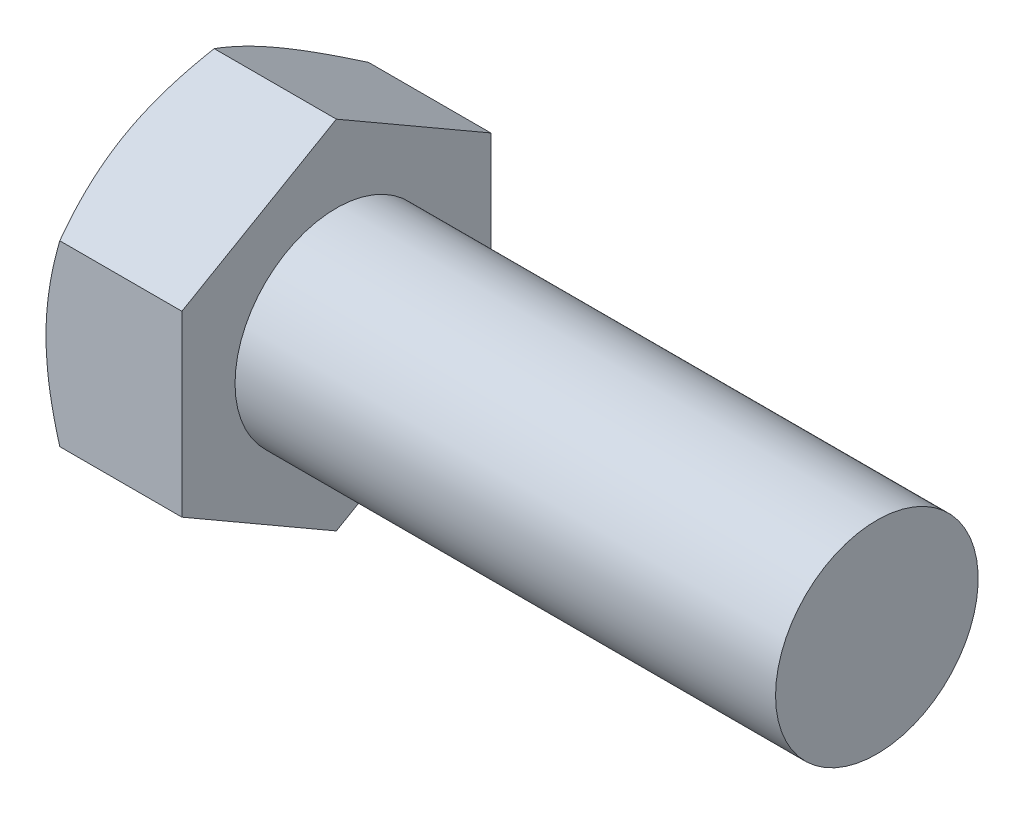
ISO-10303-21;
HEADER;
FILE_DESCRIPTION(('STEP AP214'),'2;1');
FILE_NAME('part.step','',(''),(''),'','','');
FILE_SCHEMA(('AUTOMOTIVE_DESIGN { 1 0 10303 214 1 1 1 1 }'));
ENDSEC;
DATA;
#1=APPLICATION_CONTEXT('core data for automotive mechanical design processes');
#2=APPLICATION_PROTOCOL_DEFINITION('international standard','automotive_design',2000,#1);
#3=PRODUCT_CONTEXT('',#1,'mechanical');
#4=PRODUCT('Part','Part','',(#3));
#5=PRODUCT_RELATED_PRODUCT_CATEGORY('part','',(#4));
#6=PRODUCT_DEFINITION_FORMATION('','',#4);
#7=PRODUCT_DEFINITION_CONTEXT('part definition',#1,'design');
#8=PRODUCT_DEFINITION('design','',#6,#7);
#9=PRODUCT_DEFINITION_SHAPE('','',#8);
#10=(LENGTH_UNIT() NAMED_UNIT(*) SI_UNIT(.MILLI.,.METRE.));
#11=(NAMED_UNIT(*) PLANE_ANGLE_UNIT() SI_UNIT($,.RADIAN.));
#12=(NAMED_UNIT(*) SI_UNIT($,.STERADIAN.) SOLID_ANGLE_UNIT());
#13=UNCERTAINTY_MEASURE_WITH_UNIT(LENGTH_MEASURE(1.E-05),#10,'distance_accuracy_value','');
#14=(GEOMETRIC_REPRESENTATION_CONTEXT(3) GLOBAL_UNCERTAINTY_ASSIGNED_CONTEXT((#13)) GLOBAL_UNIT_ASSIGNED_CONTEXT((#10,
#11,#12)) REPRESENTATION_CONTEXT('',''));
#15=CARTESIAN_POINT('',(0.,0.,0.));
#16=DIRECTION('',(0.,0.,1.));
#17=DIRECTION('',(1.,0.,0.));
#18=AXIS2_PLACEMENT_3D('',#15,#16,#17);
#19=CARTESIAN_POINT('',(2.794,2.0828,0.));
#20=DIRECTION('',(-1.,0.,0.));
#21=DIRECTION('',(0.,0.,1.));
#22=AXIS2_PLACEMENT_3D('',#19,#20,#21);
#23=PLANE('',#22);
#24=CARTESIAN_POINT('',(2.794,0.,0.));
#25=DIRECTION('',(-1.,0.,0.));
#26=DIRECTION('',(0.,0.,1.));
#27=AXIS2_PLACEMENT_3D('',#24,#25,#26);
#28=CIRCLE('',#27,2.0828);
#29=CARTESIAN_POINT('',(2.794,0.,2.0828));
#30=VERTEX_POINT('',#29);
#31=EDGE_CURVE('E189',#30,#30,#28,.T.);
#32=ORIENTED_EDGE('',*,*,#31,.T.);
#33=EDGE_LOOP('',(#32));
#34=FACE_BOUND('',#33,.T.);
#35=DIRECTION('',(0.,1.,0.));
#36=VECTOR('',#35,1.);
#37=CARTESIAN_POINT('',(2.794,-1.83308711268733,3.175));
#38=LINE('',#37,#36);
#39=CARTESIAN_POINT('',(2.794,-1.83308711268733,3.175));
#40=VERTEX_POINT('',#39);
#41=CARTESIAN_POINT('',(2.794,1.83308711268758,3.175));
#42=VERTEX_POINT('',#41);
#43=EDGE_CURVE('E53',#40,#42,#38,.T.);
#44=ORIENTED_EDGE('',*,*,#43,.F.);
#45=DIRECTION('',(0.,0.50000000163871,0.866025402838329));
#46=VECTOR('',#45,1.);
#47=CARTESIAN_POINT('',(2.794,-3.66617422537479,0.));
#48=LINE('',#47,#46);
#49=CARTESIAN_POINT('',(2.794,-3.66617422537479,0.));
#50=VERTEX_POINT('',#49);
#51=EDGE_CURVE('E126',#50,#40,#48,.T.);
#52=ORIENTED_EDGE('',*,*,#51,.F.);
#53=DIRECTION('',(0.,-0.50000000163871,0.866025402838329));
#54=VECTOR('',#53,1.);
#55=CARTESIAN_POINT('',(2.794,-1.83308711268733,-3.175));
#56=LINE('',#55,#54);
#57=CARTESIAN_POINT('',(2.794,-1.83308711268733,-3.175));
#58=VERTEX_POINT('',#57);
#59=EDGE_CURVE('E124',#58,#50,#56,.T.);
#60=ORIENTED_EDGE('',*,*,#59,.F.);
#61=DIRECTION('',(0.,-1.,0.));
#62=VECTOR('',#61,1.);
#63=CARTESIAN_POINT('',(2.794,1.83308711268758,-3.175));
#64=LINE('',#63,#62);
#65=CARTESIAN_POINT('',(2.794,1.83308711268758,-3.175));
#66=VERTEX_POINT('',#65);
#67=EDGE_CURVE('E107',#66,#58,#64,.T.);
#68=ORIENTED_EDGE('',*,*,#67,.F.);
#69=DIRECTION('',(0.,-0.50000000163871,-0.866025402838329));
#70=VECTOR('',#69,1.);
#71=CARTESIAN_POINT('',(2.794,3.66617422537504,0.));
#72=LINE('',#71,#70);
#73=CARTESIAN_POINT('',(2.794,3.66617422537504,0.));
#74=VERTEX_POINT('',#73);
#75=EDGE_CURVE('E116',#74,#66,#72,.T.);
#76=ORIENTED_EDGE('',*,*,#75,.F.);
#77=DIRECTION('',(0.,0.50000000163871,-0.866025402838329));
#78=VECTOR('',#77,1.);
#79=CARTESIAN_POINT('',(2.794,1.83308711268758,3.175));
#80=LINE('',#79,#78);
#81=EDGE_CURVE('E120',#42,#74,#80,.T.);
#82=ORIENTED_EDGE('',*,*,#81,.F.);
#83=EDGE_LOOP('',(#44,#52,#60,#68,#76,#82));
#84=FACE_BOUND('',#83,.T.);
#85=ADVANCED_FACE('F30',(#34,#84),#23,.F.);
#86=CARTESIAN_POINT('',(-25.4,0.,0.));
#87=DIRECTION('',(-1.,0.,0.));
#88=DIRECTION('',(0.,0.,1.));
#89=AXIS2_PLACEMENT_3D('',#86,#87,#88);
#90=CYLINDRICAL_SURFACE('',#89,2.0828);
#91=CARTESIAN_POINT('',(13.9065,0.,0.));
#92=DIRECTION('',(-1.,0.,0.));
#93=DIRECTION('',(0.,0.,1.));
#94=AXIS2_PLACEMENT_3D('',#91,#92,#93);
#95=CIRCLE('',#94,2.0828);
#96=CARTESIAN_POINT('',(13.9065,0.,2.0828));
#97=VERTEX_POINT('',#96);
#98=EDGE_CURVE('E11',#97,#97,#95,.T.);
#99=ORIENTED_EDGE('',*,*,#98,.T.);
#100=EDGE_LOOP('',(#99));
#101=FACE_BOUND('',#100,.T.);
#102=ORIENTED_EDGE('',*,*,#31,.F.);
#103=EDGE_LOOP('',(#102));
#104=FACE_BOUND('',#103,.T.);
#105=ADVANCED_FACE('F32',(#101,#104),#90,.T.);
#106=CARTESIAN_POINT('',(13.9065,2.0828,0.));
#107=DIRECTION('',(1.,0.,0.));
#108=DIRECTION('',(0.,0.,-1.));
#109=AXIS2_PLACEMENT_3D('',#106,#107,#108);
#110=PLANE('',#109);
#111=ORIENTED_EDGE('',*,*,#98,.F.);
#112=EDGE_LOOP('',(#111));
#113=FACE_BOUND('',#112,.T.);
#114=ADVANCED_FACE('F172',(#113),#110,.T.);
#115=CARTESIAN_POINT('',(2.794,-1.83308711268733,3.175));
#116=DIRECTION('',(0.,0.,1.));
#117=DIRECTION('',(0.,-1.,0.));
#118=AXIS2_PLACEMENT_3D('',#115,#116,#117);
#119=PLANE('',#118);
#120=DIRECTION('',(-1.,0.,0.));
#121=VECTOR('',#120,1.);
#122=CARTESIAN_POINT('',(2.794,-1.83308711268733,3.175));
#123=LINE('',#122,#121);
#124=CARTESIAN_POINT('',(0.28357956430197,-1.83308711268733,3.175));
#125=VERTEX_POINT('',#124);
#126=EDGE_CURVE('E133',#40,#125,#123,.T.);
#127=ORIENTED_EDGE('',*,*,#126,.F.);
#128=ORIENTED_EDGE('',*,*,#43,.T.);
#129=DIRECTION('',(-1.,0.,0.));
#130=VECTOR('',#129,1.);
#131=CARTESIAN_POINT('',(2.794,1.83308711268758,3.175));
#132=LINE('',#131,#130);
#133=CARTESIAN_POINT('',(0.283579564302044,1.83308711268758,3.175));
#134=VERTEX_POINT('',#133);
#135=EDGE_CURVE('E132',#42,#134,#132,.T.);
#136=ORIENTED_EDGE('',*,*,#135,.T.);
#137=CARTESIAN_POINT('',(1.51932645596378,-4.86162576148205,3.175));
#138=CARTESIAN_POINT('',(1.4519603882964,-4.72222524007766,3.175));
#139=CARTESIAN_POINT('',(1.38526399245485,-4.58249513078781,3.175));
#140=CARTESIAN_POINT('',(1.25359321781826,-4.30219752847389,3.175));
#141=CARTESIAN_POINT('',(1.18861913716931,-4.16162989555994,3.175));
#142=CARTESIAN_POINT('',(1.06043338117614,-3.87871970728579,3.175));
#143=CARTESIAN_POINT('',(0.997233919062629,-3.73637159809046,3.175));
#144=CARTESIAN_POINT('',(0.873549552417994,-3.45050540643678,3.175));
#145=CARTESIAN_POINT('',(0.813064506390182,-3.30698738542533,3.175));
#146=CARTESIAN_POINT('',(0.694812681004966,-3.01677140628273,3.175));
#147=CARTESIAN_POINT('',(0.637088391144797,-2.87005603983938,3.175));
#148=CARTESIAN_POINT('',(0.526160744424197,-2.57489478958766,3.175));
#149=CARTESIAN_POINT('',(0.472957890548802,-2.42644871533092,3.175));
#150=CARTESIAN_POINT('',(0.372502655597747,-2.12789476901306,3.175));
#151=CARTESIAN_POINT('',(0.32523762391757,-1.97779119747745,3.175));
#152=CARTESIAN_POINT('',(0.238193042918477,-1.67545013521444,3.175));
#153=CARTESIAN_POINT('',(0.198411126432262,-1.52321333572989,3.175));
#154=CARTESIAN_POINT('',(0.12826407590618,-1.21650184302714,3.175));
#155=CARTESIAN_POINT('',(0.0979014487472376,-1.06202656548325,3.175));
#156=CARTESIAN_POINT('',(0.0486372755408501,-0.751213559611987,3.175));
#157=CARTESIAN_POINT('',(0.0297357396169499,-0.594875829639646,3.175));
#158=CARTESIAN_POINT('',(0.00506587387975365,-0.282146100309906,3.175));
#159=CARTESIAN_POINT('',(-0.000785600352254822,-0.125760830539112,3.175));
#160=CARTESIAN_POINT('',(0.000955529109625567,0.186900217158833,3.175));
#161=CARTESIAN_POINT('',(0.00854464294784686,0.343176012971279,3.175));
#162=CARTESIAN_POINT('',(0.0324468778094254,0.610039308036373,3.175));
#163=CARTESIAN_POINT('',(0.0456472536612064,0.720921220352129,3.175));
#164=CARTESIAN_POINT('',(0.0779558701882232,0.941828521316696,3.175));
#165=CARTESIAN_POINT('',(0.0970650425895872,1.05185377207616,3.175));
#166=CARTESIAN_POINT('',(0.162252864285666,1.38055483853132,3.175));
#167=CARTESIAN_POINT('',(0.216175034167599,1.5976899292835,3.175));
#168=CARTESIAN_POINT('',(0.309176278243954,1.92259958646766,3.175));
#169=CARTESIAN_POINT('',(0.342670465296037,2.03206774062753,3.175));
#170=CARTESIAN_POINT('',(0.412973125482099,2.24986149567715,3.175));
#171=CARTESIAN_POINT('',(0.449779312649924,2.35818782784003,3.175));
#172=CARTESIAN_POINT('',(0.525940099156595,2.57324495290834,3.175));
#173=CARTESIAN_POINT('',(0.565279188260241,2.67998129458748,3.175));
#174=CARTESIAN_POINT('',(0.646266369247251,2.89262584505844,3.175));
#175=CARTESIAN_POINT('',(0.68791539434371,2.99853369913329,3.175));
#176=CARTESIAN_POINT('',(0.730491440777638,3.10405861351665,3.175));
#177=B_SPLINE_CURVE_WITH_KNOTS('',3,(#137,#138,#139,#140,#141,#142,#143,#144,#145,#146,#147,
#148,#149,#150,#151,#152,#153,#154,#155,#156,#157,#158,#159,#160,#161,#162,#163,#164,#165,#166,
#167,#168,#169,#170,#171,#172,#173,#174,#175,#176),.UNSPECIFIED.,.F.,.F.,(4,2,2,2,2,2,2,2,2,2,2,
2,2,2,2,2,2,2,2,4),(0.,0.464480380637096,0.92904064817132,1.39625939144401,1.86345375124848,
2.33638393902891,2.80936666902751,3.28132396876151,3.7531317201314,4.22506493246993,
4.69699856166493,5.1659167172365,5.63471313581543,5.96954431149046,6.30442831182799,
6.97469471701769,7.31810047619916,7.66127100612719,8.00250994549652,8.34388776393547),.UNSPECIFIED.);
#178=CARTESIAN_POINT('',(0.,0.,3.175));
#179=VERTEX_POINT('',#178);
#180=EDGE_CURVE('E174',#179,#134,#177,.T.);
#181=ORIENTED_EDGE('',*,*,#180,.F.);
#182=EDGE_CURVE('E181',#125,#179,#177,.T.);
#183=ORIENTED_EDGE('',*,*,#182,.F.);
#184=EDGE_LOOP('',(#127,#128,#136,#181,#183));
#185=FACE_BOUND('',#184,.T.);
#186=ADVANCED_FACE('F168',(#185),#119,.T.);
#187=CARTESIAN_POINT('',(2.794,-3.66617422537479,0.));
#188=DIRECTION('',(0.,-0.866025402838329,0.50000000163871));
#189=DIRECTION('',(0.,-0.50000000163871,-0.866025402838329));
#190=AXIS2_PLACEMENT_3D('',#187,#188,#189);
#191=PLANE('',#190);
#192=DIRECTION('',(-1.,0.,0.));
#193=VECTOR('',#192,1.);
#194=CARTESIAN_POINT('',(2.794,-3.66617422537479,0.));
#195=LINE('',#194,#193);
#196=CARTESIAN_POINT('',(0.283579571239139,-3.66617422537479,0.));
#197=VERTEX_POINT('',#196);
#198=EDGE_CURVE('E137',#50,#197,#195,.T.);
#199=ORIENTED_EDGE('',*,*,#198,.F.);
#200=ORIENTED_EDGE('',*,*,#51,.T.);
#201=ORIENTED_EDGE('',*,*,#126,.T.);
#202=CARTESIAN_POINT('',(0.283646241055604,-3.66628969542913,-0.000199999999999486));
#203=CARTESIAN_POINT('',(0.237119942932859,-3.58573466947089,0.13932539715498));
#204=CARTESIAN_POINT('',(0.194805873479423,-3.50448429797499,0.280055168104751));
#205=CARTESIAN_POINT('',(0.120946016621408,-3.3405766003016,0.563951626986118));
#206=CARTESIAN_POINT('',(0.0894263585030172,-3.25791636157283,0.707123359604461));
#207=CARTESIAN_POINT('',(0.0403611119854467,-3.09362030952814,0.991692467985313));
#208=CARTESIAN_POINT('',(0.0224889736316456,-3.01200977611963,1.13304605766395));
#209=CARTESIAN_POINT('',(0.0011528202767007,-2.84840467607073,1.41641840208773));
#210=CARTESIAN_POINT('',(-0.00232886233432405,-2.7664107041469,1.55843612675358));
#211=CARTESIAN_POINT('',(0.00491170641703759,-2.61319854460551,1.82380737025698));
#212=CARTESIAN_POINT('',(0.0138561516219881,-2.54195742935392,1.94720060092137));
#213=CARTESIAN_POINT('',(0.0422055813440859,-2.39993933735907,2.19318315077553));
#214=CARTESIAN_POINT('',(0.0616202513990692,-2.32916285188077,2.3157716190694));
#215=CARTESIAN_POINT('',(0.110155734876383,-2.18685191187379,2.56226139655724));
#216=CARTESIAN_POINT('',(0.139482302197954,-2.11533547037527,2.68613150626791));
#217=CARTESIAN_POINT('',(0.20604219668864,-1.97336927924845,2.93202416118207));
#218=CARTESIAN_POINT('',(0.243259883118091,-1.90291771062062,3.05404985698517));
#219=CARTESIAN_POINT('',(0.283646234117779,-1.83297164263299,3.1752));
#220=B_SPLINE_CURVE_WITH_KNOTS('',3,(#202,#203,#204,#205,#206,#207,#208,#209,#210,#211,#212,
#213,#214,#215,#216,#217,#218,#219),.UNSPECIFIED.,.F.,.F.,(4,2,2,2,2,2,2,2,4),(0.,
0.503278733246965,1.00776724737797,1.49976969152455,1.99116790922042,2.41904880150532,
2.84732618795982,3.28510386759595,3.72202182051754),.UNSPECIFIED.);
#221=CARTESIAN_POINT('',(0.,-2.74963066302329,1.58750001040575));
#222=VERTEX_POINT('',#221);
#223=EDGE_CURVE('E183',#222,#125,#220,.T.);
#224=ORIENTED_EDGE('',*,*,#223,.F.);
#225=EDGE_CURVE('E182',#197,#222,#220,.T.);
#226=ORIENTED_EDGE('',*,*,#225,.F.);
#227=EDGE_LOOP('',(#199,#200,#201,#224,#226));
#228=FACE_BOUND('',#227,.T.);
#229=ADVANCED_FACE('F171',(#228),#191,.T.);
#230=CARTESIAN_POINT('',(2.794,-1.83308711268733,-3.175));
#231=DIRECTION('',(0.,-0.866025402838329,-0.50000000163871));
#232=DIRECTION('',(0.,0.50000000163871,-0.866025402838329));
#233=AXIS2_PLACEMENT_3D('',#230,#231,#232);
#234=PLANE('',#233);
#235=DIRECTION('',(-1.,0.,0.));
#236=VECTOR('',#235,1.);
#237=CARTESIAN_POINT('',(2.794,-1.83308711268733,-3.175));
#238=LINE('',#237,#236);
#239=CARTESIAN_POINT('',(0.28357956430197,-1.83308711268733,-3.175));
#240=VERTEX_POINT('',#239);
#241=EDGE_CURVE('E113',#58,#240,#238,.T.);
#242=ORIENTED_EDGE('',*,*,#241,.F.);
#243=ORIENTED_EDGE('',*,*,#59,.T.);
#244=ORIENTED_EDGE('',*,*,#198,.T.);
#245=CARTESIAN_POINT('',(0.283646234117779,-1.83297164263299,-3.1752));
#246=CARTESIAN_POINT('',(0.237119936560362,-1.91352666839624,-3.03567460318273));
#247=CARTESIAN_POINT('',(0.194805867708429,-1.99477703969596,-2.89494483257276));
#248=CARTESIAN_POINT('',(0.120946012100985,-2.15868473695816,-2.6110483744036));
#249=CARTESIAN_POINT('',(0.0894263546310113,-2.2413449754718,-2.46787664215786));
#250=CARTESIAN_POINT('',(0.0403611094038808,-2.40564102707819,-2.18330753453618));
#251=CARTESIAN_POINT('',(0.0224889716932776,-2.48725156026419,-2.04195394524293));
#252=CARTESIAN_POINT('',(0.00115281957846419,-2.65085665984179,-1.75858160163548));
#253=CARTESIAN_POINT('',(-0.00232886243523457,-2.73285063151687,-1.61656387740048));
#254=CARTESIAN_POINT('',(0.0049117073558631,-2.88606279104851,-1.35119263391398));
#255=CARTESIAN_POINT('',(0.0138561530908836,-2.95730390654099,-1.22779940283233));
#256=CARTESIAN_POINT('',(0.0422055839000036,-3.0993219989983,-0.981816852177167));
#257=CARTESIAN_POINT('',(0.06162025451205,-3.17009848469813,-0.85922838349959));
#258=CARTESIAN_POINT('',(0.110155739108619,-3.31240942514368,-0.612738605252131));
#259=CARTESIAN_POINT('',(0.139482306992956,-3.38392586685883,-0.488868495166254));
#260=CARTESIAN_POINT('',(0.206042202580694,-3.52589205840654,-0.242975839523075));
#261=CARTESIAN_POINT('',(0.243259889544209,-3.59634362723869,-0.120950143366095));
#262=CARTESIAN_POINT('',(0.283646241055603,-3.66628969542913,0.000200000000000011));
#263=B_SPLINE_CURVE_WITH_KNOTS('',3,(#245,#246,#247,#248,#249,#250,#251,#252,#253,#254,#255,
#256,#257,#258,#259,#260,#261,#262),.UNSPECIFIED.,.F.,.F.,(4,2,2,2,2,2,2,2,4),(0.,
0.503278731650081,1.0077672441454,1.49976968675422,1.99116790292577,2.41904879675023,
2.84732618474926,3.28510386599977,3.72202182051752),.UNSPECIFIED.);
#264=CARTESIAN_POINT('',(0.,-2.74963066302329,-1.58750001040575));
#265=VERTEX_POINT('',#264);
#266=EDGE_CURVE('E212',#265,#197,#263,.T.);
#267=ORIENTED_EDGE('',*,*,#266,.F.);
#268=EDGE_CURVE('E217',#240,#265,#263,.T.);
#269=ORIENTED_EDGE('',*,*,#268,.F.);
#270=EDGE_LOOP('',(#242,#243,#244,#267,#269));
#271=FACE_BOUND('',#270,.T.);
#272=ADVANCED_FACE('F244',(#271),#234,.T.);
#273=CARTESIAN_POINT('',(2.794,1.83308711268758,-3.175));
#274=DIRECTION('',(0.,0.,-1.));
#275=DIRECTION('',(-1.,0.,0.));
#276=AXIS2_PLACEMENT_3D('',#273,#274,#275);
#277=PLANE('',#276);
#278=DIRECTION('',(-1.,0.,0.));
#279=VECTOR('',#278,1.);
#280=CARTESIAN_POINT('',(2.794,1.83308711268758,-3.175));
#281=LINE('',#280,#279);
#282=CARTESIAN_POINT('',(0.283579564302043,1.83308711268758,-3.175));
#283=VERTEX_POINT('',#282);
#284=EDGE_CURVE('E102',#66,#283,#281,.T.);
#285=ORIENTED_EDGE('',*,*,#284,.F.);
#286=ORIENTED_EDGE('',*,*,#67,.T.);
#287=ORIENTED_EDGE('',*,*,#241,.T.);
#288=CARTESIAN_POINT('',(1.51932645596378,-4.86162576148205,-3.175));
#289=CARTESIAN_POINT('',(1.4519603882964,-4.72222524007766,-3.175));
#290=CARTESIAN_POINT('',(1.38526399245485,-4.58249513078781,-3.175));
#291=CARTESIAN_POINT('',(1.25359321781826,-4.30219752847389,-3.175));
#292=CARTESIAN_POINT('',(1.18861913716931,-4.16162989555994,-3.175));
#293=CARTESIAN_POINT('',(1.06043338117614,-3.87871970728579,-3.175));
#294=CARTESIAN_POINT('',(0.997233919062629,-3.73637159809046,-3.175));
#295=CARTESIAN_POINT('',(0.873549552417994,-3.45050540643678,-3.175));
#296=CARTESIAN_POINT('',(0.813064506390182,-3.30698738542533,-3.175));
#297=CARTESIAN_POINT('',(0.694812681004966,-3.01677140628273,-3.175));
#298=CARTESIAN_POINT('',(0.637088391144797,-2.87005603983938,-3.175));
#299=CARTESIAN_POINT('',(0.526160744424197,-2.57489478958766,-3.175));
#300=CARTESIAN_POINT('',(0.472957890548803,-2.42644871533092,-3.175));
#301=CARTESIAN_POINT('',(0.372502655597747,-2.12789476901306,-3.175));
#302=CARTESIAN_POINT('',(0.32523762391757,-1.97779119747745,-3.175));
#303=CARTESIAN_POINT('',(0.238193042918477,-1.67545013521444,-3.175));
#304=CARTESIAN_POINT('',(0.198411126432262,-1.52321333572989,-3.175));
#305=CARTESIAN_POINT('',(0.12826407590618,-1.21650184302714,-3.175));
#306=CARTESIAN_POINT('',(0.0979014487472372,-1.06202656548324,-3.175));
#307=CARTESIAN_POINT('',(0.0486372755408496,-0.751213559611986,-3.175));
#308=CARTESIAN_POINT('',(0.0297357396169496,-0.594875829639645,-3.175));
#309=CARTESIAN_POINT('',(0.0050658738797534,-0.282146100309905,-3.175));
#310=CARTESIAN_POINT('',(-0.00078560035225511,-0.125760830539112,-3.175));
#311=CARTESIAN_POINT('',(0.00095552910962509,0.186900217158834,-3.175));
#312=CARTESIAN_POINT('',(0.0085446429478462,0.343176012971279,-3.175));
#313=CARTESIAN_POINT('',(0.0324468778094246,0.610039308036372,-3.175));
#314=CARTESIAN_POINT('',(0.0456472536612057,0.720921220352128,-3.175));
#315=CARTESIAN_POINT('',(0.0779558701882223,0.941828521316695,-3.175));
#316=CARTESIAN_POINT('',(0.0970650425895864,1.05185377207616,-3.175));
#317=CARTESIAN_POINT('',(0.162252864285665,1.38055483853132,-3.175));
#318=CARTESIAN_POINT('',(0.216175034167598,1.5976899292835,-3.175));
#319=CARTESIAN_POINT('',(0.309176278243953,1.92259958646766,-3.175));
#320=CARTESIAN_POINT('',(0.342670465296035,2.03206774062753,-3.175));
#321=CARTESIAN_POINT('',(0.412973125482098,2.24986149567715,-3.175));
#322=CARTESIAN_POINT('',(0.449779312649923,2.35818782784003,-3.175));
#323=CARTESIAN_POINT('',(0.525940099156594,2.57324495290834,-3.175));
#324=CARTESIAN_POINT('',(0.56527918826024,2.67998129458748,-3.175));
#325=CARTESIAN_POINT('',(0.64626636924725,2.89262584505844,-3.175));
#326=CARTESIAN_POINT('',(0.687915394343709,2.99853369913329,-3.175));
#327=CARTESIAN_POINT('',(0.730491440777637,3.10405861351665,-3.175));
#328=B_SPLINE_CURVE_WITH_KNOTS('',3,(#288,#289,#290,#291,#292,#293,#294,#295,#296,#297,#298,
#299,#300,#301,#302,#303,#304,#305,#306,#307,#308,#309,#310,#311,#312,#313,#314,#315,#316,#317,
#318,#319,#320,#321,#322,#323,#324,#325,#326,#327),.UNSPECIFIED.,.F.,.F.,(4,2,2,2,2,2,2,2,2,2,2,
2,2,2,2,2,2,2,2,4),(0.,0.464480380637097,0.929040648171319,1.39625939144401,1.86345375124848,
2.33638393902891,2.80936666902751,3.28132396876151,3.7531317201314,4.22506493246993,
4.69699856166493,5.1659167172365,5.63471313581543,5.96954431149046,6.30442831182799,
6.97469471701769,7.31810047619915,7.66127100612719,8.00250994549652,8.34388776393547),.UNSPECIFIED.);
#329=CARTESIAN_POINT('',(0.,0.,-3.175));
#330=VERTEX_POINT('',#329);
#331=EDGE_CURVE('E213',#330,#240,#328,.F.);
#332=ORIENTED_EDGE('',*,*,#331,.F.);
#333=EDGE_CURVE('E110',#283,#330,#328,.F.);
#334=ORIENTED_EDGE('',*,*,#333,.F.);
#335=EDGE_LOOP('',(#285,#286,#287,#332,#334));
#336=FACE_BOUND('',#335,.T.);
#337=ADVANCED_FACE('F104',(#336),#277,.T.);
#338=CARTESIAN_POINT('',(2.794,3.66617422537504,0.));
#339=DIRECTION('',(0.,0.866025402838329,-0.50000000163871));
#340=DIRECTION('',(0.,0.50000000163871,0.866025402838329));
#341=AXIS2_PLACEMENT_3D('',#338,#339,#340);
#342=PLANE('',#341);
#343=DIRECTION('',(-1.,0.,0.));
#344=VECTOR('',#343,1.);
#345=CARTESIAN_POINT('',(2.794,3.66617422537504,0.));
#346=LINE('',#345,#344);
#347=CARTESIAN_POINT('',(0.283579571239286,3.66617422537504,0.));
#348=VERTEX_POINT('',#347);
#349=EDGE_CURVE('E45',#74,#348,#346,.T.);
#350=ORIENTED_EDGE('',*,*,#349,.F.);
#351=ORIENTED_EDGE('',*,*,#75,.T.);
#352=ORIENTED_EDGE('',*,*,#284,.T.);
#353=CARTESIAN_POINT('',(0.283646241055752,3.66628969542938,0.000200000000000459));
#354=CARTESIAN_POINT('',(0.237119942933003,3.58573466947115,-0.139325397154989));
#355=CARTESIAN_POINT('',(0.194805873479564,3.50448429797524,-0.280055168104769));
#356=CARTESIAN_POINT('',(0.120946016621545,3.34057660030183,-0.563951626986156));
#357=CARTESIAN_POINT('',(0.0894263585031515,3.25791636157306,-0.707123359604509));
#358=CARTESIAN_POINT('',(0.0403611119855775,3.09362030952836,-0.991692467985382));
#359=CARTESIAN_POINT('',(0.0224889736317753,3.01200977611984,-1.13304605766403));
#360=CARTESIAN_POINT('',(0.00115282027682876,2.84840467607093,-1.41641840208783));
#361=CARTESIAN_POINT('',(-0.00232886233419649,2.76641070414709,-1.55843612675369));
#362=CARTESIAN_POINT('',(0.00491170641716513,2.6131985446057,-1.82380737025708));
#363=CARTESIAN_POINT('',(0.0138561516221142,2.54195742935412,-1.94720060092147));
#364=CARTESIAN_POINT('',(0.0422055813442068,2.39993933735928,-2.19318315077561));
#365=CARTESIAN_POINT('',(0.0616202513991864,2.32916285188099,-2.31577161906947));
#366=CARTESIAN_POINT('',(0.110155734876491,2.18685191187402,-2.56226139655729));
#367=CARTESIAN_POINT('',(0.139482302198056,2.11533547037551,-2.68613150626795));
#368=CARTESIAN_POINT('',(0.206042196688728,1.9733692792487,-2.93202416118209));
#369=CARTESIAN_POINT('',(0.243259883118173,1.90291771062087,-3.05404985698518));
#370=CARTESIAN_POINT('',(0.283646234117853,1.83297164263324,-3.1752));
#371=B_SPLINE_CURVE_WITH_KNOTS('',3,(#353,#354,#355,#356,#357,#358,#359,#360,#361,#362,#363,
#364,#365,#366,#367,#368,#369,#370),.UNSPECIFIED.,.F.,.F.,(4,2,2,2,2,2,2,2,4),(0.,
0.503278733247,1.00776724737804,1.49976969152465,1.99116790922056,2.41904880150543,
2.84732618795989,3.28510386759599,3.72202182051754),.UNSPECIFIED.);
#372=CARTESIAN_POINT('',(0.,2.74963066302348,-1.58750001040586));
#373=VERTEX_POINT('',#372);
#374=EDGE_CURVE('E151',#373,#283,#371,.T.);
#375=ORIENTED_EDGE('',*,*,#374,.F.);
#376=EDGE_CURVE('E234',#348,#373,#371,.T.);
#377=ORIENTED_EDGE('',*,*,#376,.F.);
#378=EDGE_LOOP('',(#350,#351,#352,#375,#377));
#379=FACE_BOUND('',#378,.T.);
#380=ADVANCED_FACE('F117',(#379),#342,.T.);
#381=CARTESIAN_POINT('',(2.794,1.83308711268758,3.175));
#382=DIRECTION('',(0.,0.866025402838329,0.50000000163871));
#383=DIRECTION('',(0.,-0.50000000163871,0.866025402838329));
#384=AXIS2_PLACEMENT_3D('',#381,#382,#383);
#385=PLANE('',#384);
#386=ORIENTED_EDGE('',*,*,#135,.F.);
#387=ORIENTED_EDGE('',*,*,#81,.T.);
#388=ORIENTED_EDGE('',*,*,#349,.T.);
#389=CARTESIAN_POINT('',(0.283646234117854,1.83297164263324,3.1752));
#390=CARTESIAN_POINT('',(0.23711993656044,1.9135266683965,3.03567460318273));
#391=CARTESIAN_POINT('',(0.194805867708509,1.99477703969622,2.89494483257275));
#392=CARTESIAN_POINT('',(0.120946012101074,2.15868473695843,2.61104837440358));
#393=CARTESIAN_POINT('',(0.0894263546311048,2.24134497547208,2.46787664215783));
#394=CARTESIAN_POINT('',(0.0403611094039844,2.40564102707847,2.18330753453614));
#395=CARTESIAN_POINT('',(0.0224889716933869,2.48725156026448,2.04195394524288));
#396=CARTESIAN_POINT('',(0.00115281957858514,2.65085665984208,1.75858160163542));
#397=CARTESIAN_POINT('',(-0.00232886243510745,2.73285063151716,1.61656387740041));
#398=CARTESIAN_POINT('',(0.00491170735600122,2.8860627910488,1.35119263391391));
#399=CARTESIAN_POINT('',(0.0138561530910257,2.95730390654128,1.22779940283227));
#400=CARTESIAN_POINT('',(0.0422055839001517,3.09932199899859,0.981816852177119));
#401=CARTESIAN_POINT('',(0.0616202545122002,3.17009848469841,0.859228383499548));
#402=CARTESIAN_POINT('',(0.110155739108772,3.31240942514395,0.612738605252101));
#403=CARTESIAN_POINT('',(0.139482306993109,3.3839258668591,0.488868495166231));
#404=CARTESIAN_POINT('',(0.206042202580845,3.52589205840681,0.242975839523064));
#405=CARTESIAN_POINT('',(0.243259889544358,3.59634362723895,0.120950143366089));
#406=CARTESIAN_POINT('',(0.283646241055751,3.66628969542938,-0.00020000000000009));
#407=B_SPLINE_CURVE_WITH_KNOTS('',3,(#389,#390,#391,#392,#393,#394,#395,#396,#397,#398,#399,
#400,#401,#402,#403,#404,#405,#406),.UNSPECIFIED.,.F.,.F.,(4,2,2,2,2,2,2,2,4),(0.,
0.503278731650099,1.00776724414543,1.49976968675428,1.99116790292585,2.41904879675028,
2.8473261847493,3.28510386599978,3.72202182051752),.UNSPECIFIED.);
#408=CARTESIAN_POINT('',(0.,2.74963066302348,1.58750001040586));
#409=VERTEX_POINT('',#408);
#410=EDGE_CURVE('E136',#409,#348,#407,.T.);
#411=ORIENTED_EDGE('',*,*,#410,.F.);
#412=EDGE_CURVE('E150',#134,#409,#407,.T.);
#413=ORIENTED_EDGE('',*,*,#412,.F.);
#414=EDGE_LOOP('',(#386,#387,#388,#411,#413));
#415=FACE_BOUND('',#414,.T.);
#416=ADVANCED_FACE('F161',(#415),#385,.T.);
#417=CARTESIAN_POINT('',(0.,0.,0.));
#418=DIRECTION('',(1.,0.,0.));
#419=DIRECTION('',(0.,0.,-1.));
#420=AXIS2_PLACEMENT_3D('',#417,#418,#419);
#421=CONICAL_SURFACE('',#420,3.175,1.0471975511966);
#422=CARTESIAN_POINT('',(0.,0.,0.));
#423=DIRECTION('',(-1.,0.,0.));
#424=DIRECTION('',(0.,0.,1.));
#425=AXIS2_PLACEMENT_3D('',#422,#423,#424);
#426=CIRCLE('',#425,3.175);
#427=EDGE_CURVE('E191',#222,#179,#426,.T.);
#428=ORIENTED_EDGE('',*,*,#427,.F.);
#429=ORIENTED_EDGE('',*,*,#223,.T.);
#430=ORIENTED_EDGE('',*,*,#182,.T.);
#431=EDGE_LOOP('',(#428,#429,#430));
#432=FACE_BOUND('',#431,.T.);
#433=ADVANCED_FACE('F165',(#432),#421,.T.);
#434=EDGE_CURVE('E199',#265,#222,#426,.T.);
#435=ORIENTED_EDGE('',*,*,#434,.F.);
#436=ORIENTED_EDGE('',*,*,#266,.T.);
#437=ORIENTED_EDGE('',*,*,#225,.T.);
#438=EDGE_LOOP('',(#435,#436,#437));
#439=FACE_BOUND('',#438,.T.);
#440=ADVANCED_FACE('F222',(#439),#421,.T.);
#441=ORIENTED_EDGE('',*,*,#331,.T.);
#442=ORIENTED_EDGE('',*,*,#268,.T.);
#443=EDGE_CURVE('E202',#330,#265,#426,.T.);
#444=ORIENTED_EDGE('',*,*,#443,.F.);
#445=EDGE_LOOP('',(#441,#442,#444));
#446=FACE_BOUND('',#445,.T.);
#447=ADVANCED_FACE('F157',(#446),#421,.T.);
#448=ORIENTED_EDGE('',*,*,#374,.T.);
#449=ORIENTED_EDGE('',*,*,#333,.T.);
#450=EDGE_CURVE('E198',#373,#330,#426,.T.);
#451=ORIENTED_EDGE('',*,*,#450,.F.);
#452=EDGE_LOOP('',(#448,#449,#451));
#453=FACE_BOUND('',#452,.T.);
#454=ADVANCED_FACE('F211',(#453),#421,.T.);
#455=EDGE_CURVE('E38',#179,#409,#426,.T.);
#456=ORIENTED_EDGE('',*,*,#455,.F.);
#457=ORIENTED_EDGE('',*,*,#180,.T.);
#458=ORIENTED_EDGE('',*,*,#412,.T.);
#459=EDGE_LOOP('',(#456,#457,#458));
#460=FACE_BOUND('',#459,.T.);
#461=ADVANCED_FACE('F230',(#460),#421,.T.);
#462=CARTESIAN_POINT('',(0.,0.,0.));
#463=DIRECTION('',(-1.,0.,0.));
#464=DIRECTION('',(0.,0.,1.));
#465=AXIS2_PLACEMENT_3D('',#462,#463,#464);
#466=PLANE('',#465);
#467=ORIENTED_EDGE('',*,*,#455,.T.);
#468=EDGE_CURVE('E193',#409,#373,#426,.T.);
#469=ORIENTED_EDGE('',*,*,#468,.T.);
#470=ORIENTED_EDGE('',*,*,#450,.T.);
#471=ORIENTED_EDGE('',*,*,#443,.T.);
#472=ORIENTED_EDGE('',*,*,#434,.T.);
#473=ORIENTED_EDGE('',*,*,#427,.T.);
#474=EDGE_LOOP('',(#467,#469,#470,#471,#472,#473));
#475=FACE_BOUND('',#474,.T.);
#476=ADVANCED_FACE('F208',(#475),#466,.T.);
#477=ORIENTED_EDGE('',*,*,#410,.T.);
#478=ORIENTED_EDGE('',*,*,#376,.T.);
#479=ORIENTED_EDGE('',*,*,#468,.F.);
#480=EDGE_LOOP('',(#477,#478,#479));
#481=FACE_BOUND('',#480,.T.);
#482=ADVANCED_FACE('F233',(#481),#421,.T.);
#483=CLOSED_SHELL('',(#85,#105,#114,#186,#229,#272,#337,#380,#416,#433,#440,#447,#454,#461,#476,#482));
#484=MANIFOLD_SOLID_BREP('B2',#483);
#485=ADVANCED_BREP_SHAPE_REPRESENTATION('',(#18,#484),#14);
#486=SHAPE_DEFINITION_REPRESENTATION(#9,#485);
ENDSEC;
END-ISO-10303-21;
